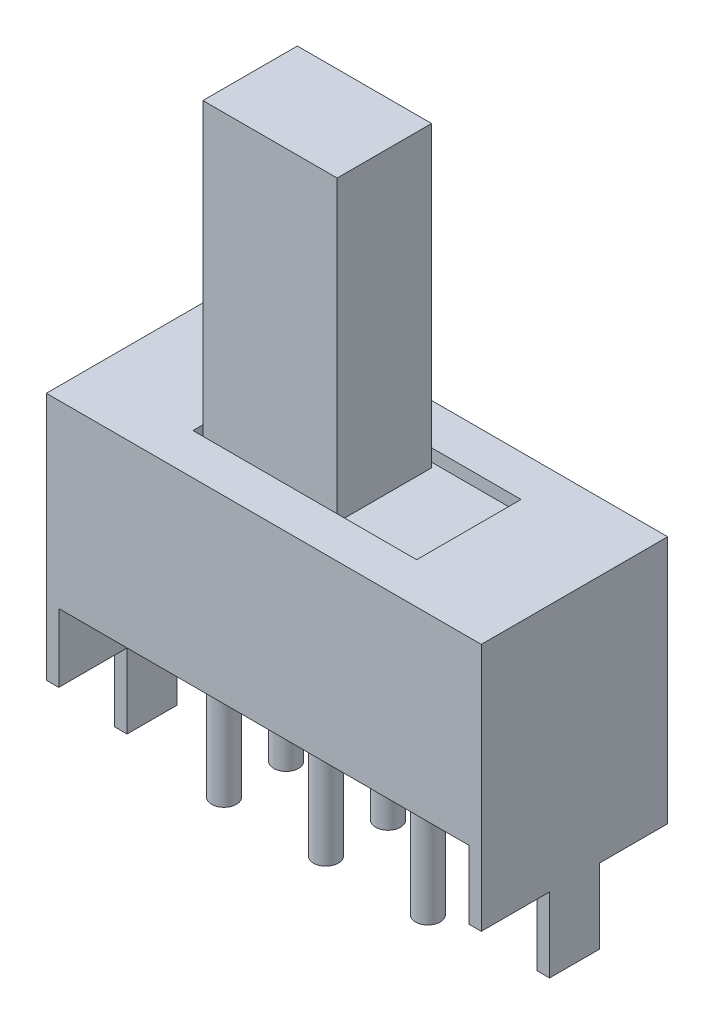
from build123d import *

# Parameters (mm, degrees)
ESQUISSE1_W             = 16.5
ESQUISSE1_H             = 7.25
EXTRUSION1_DEPTH        = 7.5
EXTRUSION2_DEPTH        = 0.5
ESQUISSE3_W             = 9
ESQUISSE3_H             = 4.2
ENL_V_MAT_EXTRU_1_DEPTH = 0.5
ESQUISSE4_W             = 5.4
ESQUISSE4_H             = 3.8
EXTRUSION3_DEPTH        = 12
ESQUISSE5_R             = 0.5
EXTRUSION4_DEPTH        = 5.75


with BuildPart() as part:
    # Esquisse1 → Extrusion1 (new body)
    with BuildSketch(Plane.XY):
        with Locations((0, 3.625)):
            Rectangle(ESQUISSE1_W, ESQUISSE1_H)
    extrude(amount=EXTRUSION1_DEPTH)

    # Esquisse2 → Extrusion2 (add)
    with BuildSketch(Plane(origin=(8.25, 0, 0), x_dir=(0, 0, -1), z_dir=(1, 0, 0))):
        Polygon((-2.75, -2.75), (-2.75, -5.75), (-4.75, -5.75), (-4.75, -2.75), (-7.5, -2.75), (-7.5, 7.25), (0, 7.25), (0, -2.75), align=None)
    extrusion2 = extrude(amount=EXTRUSION2_DEPTH)

    # Sym_trie1: Extrusion2 across plane
    add(extrusion2.mirror(Plane(origin=(0, 0, 0), x_dir=(0, 0, 1), z_dir=(1, 0, 0))))

    # Esquisse3 → Enl_v. mat.-Extru.1 (cut)
    with BuildSketch(Plane(origin=(0, 7.25, 0), x_dir=(-1, 0, 0), z_dir=(0, 1, 0))):
        with Locations((0, 3.75)):
            Rectangle(ESQUISSE3_W, ESQUISSE3_H)
    extrude(amount=-ENL_V_MAT_EXTRU_1_DEPTH, mode=Mode.SUBTRACT)

    # Esquisse4 → Extrusion3 (add)
    with BuildSketch(Plane(origin=(0, 6.75, 0), x_dir=(-1, 0, 0), z_dir=(0, 1, 0))):
        with Locations((1.6, 3.75)):
            Rectangle(ESQUISSE4_W, ESQUISSE4_H)
    extrude(amount=EXTRUSION3_DEPTH)

    # Esquisse5 → Extrusion4 (add)
    with BuildSketch(Plane.XZ):
        with Locations(Location((-4.1, 2.5, 0), (0, 0, 90))):
            Circle(ESQUISSE5_R)
        with Locations(Location((0, 2.5, 0), (0, 0, 90))):
            Circle(ESQUISSE5_R)
        with Locations(Location((4.1, 2.5, 0), (0, 0, 90))):
            Circle(ESQUISSE5_R)
        with Locations(Location((-4.1, 5, 0), (0, 0, 90))):
            Circle(ESQUISSE5_R)
        with Locations(Location((0, 5, 0), (0, 0, 90))):
            Circle(ESQUISSE5_R)
        with Locations(Location((4.1, 5, 0), (0, 0, 90))):
            Circle(ESQUISSE5_R)
    extrude(amount=EXTRUSION4_DEPTH)


solid = part.part
